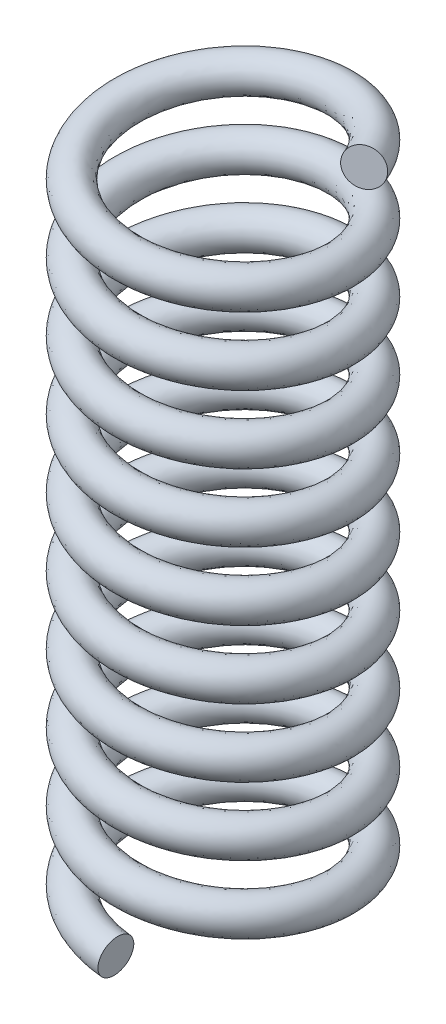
from build123d import *

# Parameters (mm, degrees)
SWEEP2_PITCH  = 19
SWEEP2_HEIGHT = 184
SWEEP2_RADIUS = 30
SKETCH5_R     = 5


with BuildPart() as part:
    # Sweep2: sweep along a helix
    with BuildLine() as sweep2_path:
        Helix(SWEEP2_PITCH, SWEEP2_HEIGHT, SWEEP2_RADIUS, center=(0, 0, 0), direction=(0, 1, 0), lefthand=True)
    # Sketch5 → Sweep2 (sweep)
    with BuildSketch(Plane(origin=(27.4731998, 184, -12.05086274), x_dir=(0.879804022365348, -0.32098855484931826, -0.35058697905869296), z_dir=(0.3996701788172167, 0.10028993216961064, 0.911156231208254))):
        Circle(SKETCH5_R)
    sweep(path=sweep2_path.line, is_frenet=True)


solid = part.part
